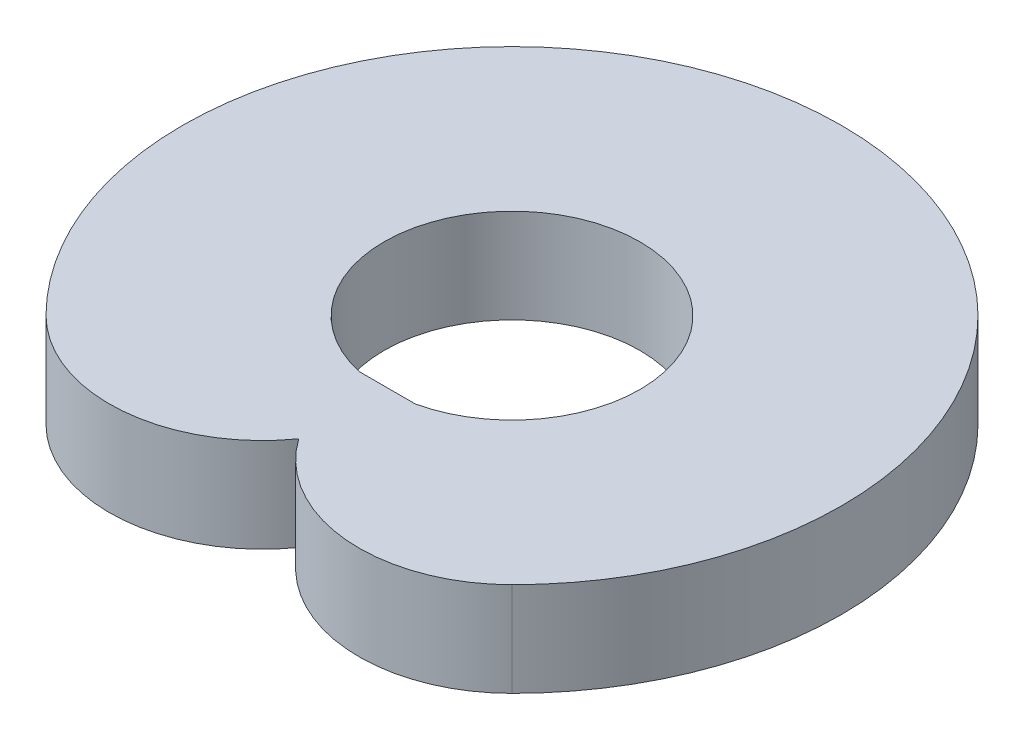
from build123d import *

# Parameters (mm, degrees)
EXTRUDE_1_DEPTH = 200


with BuildPart() as part:
    # Sketch 1 → Extrude 1 (new body)
    with BuildSketch(Plane(origin=(0, 0, 0), x_dir=(1, 0, 0), z_dir=(0, 1, 0))):
        with BuildLine():
            ThreePointArc((494.974746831, -494.974746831), (0, 700), (-494.974746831, -494.974746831))
            ThreePointArc((-494.974746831, -494.974746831), (-237.755805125, -589.007186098), (0, -453.081247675))
            ThreePointArc((0, -453.081247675), (237.755805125, -589.007186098), (494.974746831, -494.974746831))
        make_face()
        with BuildLine():
            Line((59.834957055, -265.165042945), (-59.834957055, -265.165042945))
            ThreePointArc((-59.834957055, -265.165042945), (0, 271.832157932), (59.834957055, -265.165042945))
        make_face(mode=Mode.SUBTRACT)
    extrude(amount=EXTRUDE_1_DEPTH)


solid = part.part
